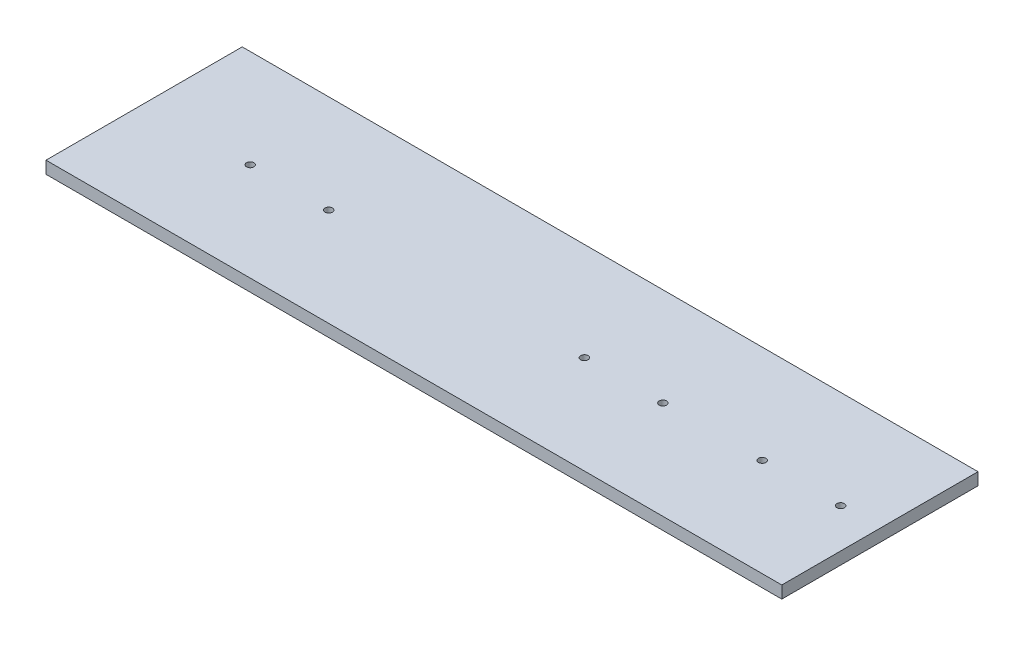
ISO-10303-21;
HEADER;
FILE_DESCRIPTION(('STEP AP214'),'2;1');
FILE_NAME('part.step','',(''),(''),'','','');
FILE_SCHEMA(('AUTOMOTIVE_DESIGN { 1 0 10303 214 1 1 1 1 }'));
ENDSEC;
DATA;
#1=APPLICATION_CONTEXT('core data for automotive mechanical design processes');
#2=APPLICATION_PROTOCOL_DEFINITION('international standard','automotive_design',2000,#1);
#3=PRODUCT_CONTEXT('',#1,'mechanical');
#4=PRODUCT('Part','Part','',(#3));
#5=PRODUCT_RELATED_PRODUCT_CATEGORY('part','',(#4));
#6=PRODUCT_DEFINITION_FORMATION('','',#4);
#7=PRODUCT_DEFINITION_CONTEXT('part definition',#1,'design');
#8=PRODUCT_DEFINITION('design','',#6,#7);
#9=PRODUCT_DEFINITION_SHAPE('','',#8);
#10=(LENGTH_UNIT() NAMED_UNIT(*) SI_UNIT(.MILLI.,.METRE.));
#11=(NAMED_UNIT(*) PLANE_ANGLE_UNIT() SI_UNIT($,.RADIAN.));
#12=(NAMED_UNIT(*) SI_UNIT($,.STERADIAN.) SOLID_ANGLE_UNIT());
#13=UNCERTAINTY_MEASURE_WITH_UNIT(LENGTH_MEASURE(1.E-05),#10,'distance_accuracy_value','');
#14=(GEOMETRIC_REPRESENTATION_CONTEXT(3) GLOBAL_UNCERTAINTY_ASSIGNED_CONTEXT((#13)) GLOBAL_UNIT_ASSIGNED_CONTEXT((#10,
#11,#12)) REPRESENTATION_CONTEXT('',''));
#15=CARTESIAN_POINT('',(0.,0.,0.));
#16=DIRECTION('',(0.,0.,1.));
#17=DIRECTION('',(1.,0.,0.));
#18=AXIS2_PLACEMENT_3D('',#15,#16,#17);
#19=CARTESIAN_POINT('',(300.,10.,80.));
#20=DIRECTION('',(-1.,0.,0.));
#21=DIRECTION('',(0.,0.,1.));
#22=AXIS2_PLACEMENT_3D('',#19,#20,#21);
#23=PLANE('',#22);
#24=DIRECTION('',(0.,0.,-1.));
#25=VECTOR('',#24,1.);
#26=CARTESIAN_POINT('',(300.,0.,80.));
#27=LINE('',#26,#25);
#28=CARTESIAN_POINT('',(300.,0.,80.));
#29=VERTEX_POINT('',#28);
#30=CARTESIAN_POINT('',(300.,0.,-80.));
#31=VERTEX_POINT('',#30);
#32=EDGE_CURVE('E96',#29,#31,#27,.T.);
#33=ORIENTED_EDGE('',*,*,#32,.T.);
#34=DIRECTION('',(0.,-1.,0.));
#35=VECTOR('',#34,1.);
#36=CARTESIAN_POINT('',(300.,10.,-80.));
#37=LINE('',#36,#35);
#38=CARTESIAN_POINT('',(300.,10.,-80.));
#39=VERTEX_POINT('',#38);
#40=EDGE_CURVE('E11',#39,#31,#37,.T.);
#41=ORIENTED_EDGE('',*,*,#40,.F.);
#42=DIRECTION('',(0.,0.,-1.));
#43=VECTOR('',#42,1.);
#44=CARTESIAN_POINT('',(300.,10.,80.));
#45=LINE('',#44,#43);
#46=CARTESIAN_POINT('',(300.,10.,80.));
#47=VERTEX_POINT('',#46);
#48=EDGE_CURVE('E84',#47,#39,#45,.T.);
#49=ORIENTED_EDGE('',*,*,#48,.F.);
#50=DIRECTION('',(0.,-1.,0.));
#51=VECTOR('',#50,1.);
#52=CARTESIAN_POINT('',(300.,10.,80.));
#53=LINE('',#52,#51);
#54=EDGE_CURVE('E92',#47,#29,#53,.T.);
#55=ORIENTED_EDGE('',*,*,#54,.T.);
#56=EDGE_LOOP('',(#33,#41,#49,#55));
#57=FACE_BOUND('',#56,.T.);
#58=ADVANCED_FACE('F33',(#57),#23,.F.);
#59=CARTESIAN_POINT('',(-300.,10.,-80.));
#60=DIRECTION('',(0.,0.,1.));
#61=DIRECTION('',(1.,0.,0.));
#62=AXIS2_PLACEMENT_3D('',#59,#60,#61);
#63=PLANE('',#62);
#64=DIRECTION('',(-1.,0.,0.));
#65=VECTOR('',#64,1.);
#66=CARTESIAN_POINT('',(-300.,0.,-80.));
#67=LINE('',#66,#65);
#68=CARTESIAN_POINT('',(-300.,0.,-80.));
#69=VERTEX_POINT('',#68);
#70=EDGE_CURVE('E88',#31,#69,#67,.T.);
#71=ORIENTED_EDGE('',*,*,#70,.T.);
#72=DIRECTION('',(0.,-1.,0.));
#73=VECTOR('',#72,1.);
#74=CARTESIAN_POINT('',(-300.,10.,-80.));
#75=LINE('',#74,#73);
#76=CARTESIAN_POINT('',(-300.,10.,-80.));
#77=VERTEX_POINT('',#76);
#78=EDGE_CURVE('E41',#77,#69,#75,.T.);
#79=ORIENTED_EDGE('',*,*,#78,.F.);
#80=DIRECTION('',(-1.,0.,0.));
#81=VECTOR('',#80,1.);
#82=CARTESIAN_POINT('',(-300.,10.,-80.));
#83=LINE('',#82,#81);
#84=EDGE_CURVE('E79',#39,#77,#83,.T.);
#85=ORIENTED_EDGE('',*,*,#84,.F.);
#86=ORIENTED_EDGE('',*,*,#40,.T.);
#87=EDGE_LOOP('',(#71,#79,#85,#86));
#88=FACE_BOUND('',#87,.T.);
#89=ADVANCED_FACE('F87',(#88),#63,.F.);
#90=CARTESIAN_POINT('',(-300.,10.,80.));
#91=DIRECTION('',(1.,0.,0.));
#92=DIRECTION('',(0.,0.,-1.));
#93=AXIS2_PLACEMENT_3D('',#90,#91,#92);
#94=PLANE('',#93);
#95=DIRECTION('',(0.,0.,1.));
#96=VECTOR('',#95,1.);
#97=CARTESIAN_POINT('',(-300.,0.,80.));
#98=LINE('',#97,#96);
#99=CARTESIAN_POINT('',(-300.,0.,80.));
#100=VERTEX_POINT('',#99);
#101=EDGE_CURVE('E66',#69,#100,#98,.T.);
#102=ORIENTED_EDGE('',*,*,#101,.T.);
#103=DIRECTION('',(0.,-1.,0.));
#104=VECTOR('',#103,1.);
#105=CARTESIAN_POINT('',(-300.,10.,80.));
#106=LINE('',#105,#104);
#107=CARTESIAN_POINT('',(-300.,10.,80.));
#108=VERTEX_POINT('',#107);
#109=EDGE_CURVE('E89',#108,#100,#106,.T.);
#110=ORIENTED_EDGE('',*,*,#109,.F.);
#111=DIRECTION('',(0.,0.,1.));
#112=VECTOR('',#111,1.);
#113=CARTESIAN_POINT('',(-300.,10.,80.));
#114=LINE('',#113,#112);
#115=EDGE_CURVE('E82',#77,#108,#114,.T.);
#116=ORIENTED_EDGE('',*,*,#115,.F.);
#117=ORIENTED_EDGE('',*,*,#78,.T.);
#118=EDGE_LOOP('',(#102,#110,#116,#117));
#119=FACE_BOUND('',#118,.T.);
#120=ADVANCED_FACE('F90',(#119),#94,.F.);
#121=CARTESIAN_POINT('',(-300.,10.,80.));
#122=DIRECTION('',(0.,0.,-1.));
#123=DIRECTION('',(-1.,0.,0.));
#124=AXIS2_PLACEMENT_3D('',#121,#122,#123);
#125=PLANE('',#124);
#126=DIRECTION('',(1.,0.,0.));
#127=VECTOR('',#126,1.);
#128=CARTESIAN_POINT('',(-300.,0.,80.));
#129=LINE('',#128,#127);
#130=EDGE_CURVE('E72',#100,#29,#129,.T.);
#131=ORIENTED_EDGE('',*,*,#130,.T.);
#132=ORIENTED_EDGE('',*,*,#54,.F.);
#133=DIRECTION('',(1.,0.,0.));
#134=VECTOR('',#133,1.);
#135=CARTESIAN_POINT('',(-300.,10.,80.));
#136=LINE('',#135,#134);
#137=EDGE_CURVE('E49',#108,#47,#136,.T.);
#138=ORIENTED_EDGE('',*,*,#137,.F.);
#139=ORIENTED_EDGE('',*,*,#109,.T.);
#140=EDGE_LOOP('',(#131,#132,#138,#139));
#141=FACE_BOUND('',#140,.T.);
#142=ADVANCED_FACE('F104',(#141),#125,.F.);
#143=CARTESIAN_POINT('',(0.,10.,0.));
#144=DIRECTION('',(0.,-1.,0.));
#145=DIRECTION('',(0.,0.,-1.));
#146=AXIS2_PLACEMENT_3D('',#143,#144,#145);
#147=PLANE('',#146);
#148=CARTESIAN_POINT('',(-149.473266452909,10.,0.));
#149=DIRECTION('',(0.,-1.,0.));
#150=DIRECTION('',(0.,0.,-1.));
#151=AXIS2_PLACEMENT_3D('',#148,#149,#150);
#152=CIRCLE('',#151,2.99999999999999);
#153=CARTESIAN_POINT('',(-149.473266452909,10.,-2.99999999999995));
#154=VERTEX_POINT('',#153);
#155=EDGE_CURVE('E113',#154,#154,#152,.T.);
#156=ORIENTED_EDGE('',*,*,#155,.T.);
#157=EDGE_LOOP('',(#156));
#158=FACE_BOUND('',#157,.T.);
#159=CARTESIAN_POINT('',(59.,10.,0.));
#160=DIRECTION('',(0.,-1.,0.));
#161=DIRECTION('',(0.,0.,-1.));
#162=AXIS2_PLACEMENT_3D('',#159,#160,#161);
#163=CIRCLE('',#162,3.);
#164=CARTESIAN_POINT('',(59.,10.,-2.99999999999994));
#165=VERTEX_POINT('',#164);
#166=EDGE_CURVE('E137',#165,#165,#163,.T.);
#167=ORIENTED_EDGE('',*,*,#166,.T.);
#168=EDGE_LOOP('',(#167));
#169=FACE_BOUND('',#168,.T.);
#170=CARTESIAN_POINT('',(123.,10.,0.));
#171=DIRECTION('',(0.,-1.,0.));
#172=DIRECTION('',(0.,0.,-1.));
#173=AXIS2_PLACEMENT_3D('',#170,#171,#172);
#174=CIRCLE('',#173,2.99999999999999);
#175=CARTESIAN_POINT('',(123.,10.,-2.99999999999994));
#176=VERTEX_POINT('',#175);
#177=EDGE_CURVE('E131',#176,#176,#174,.T.);
#178=ORIENTED_EDGE('',*,*,#177,.T.);
#179=EDGE_LOOP('',(#178));
#180=FACE_BOUND('',#179,.T.);
#181=CARTESIAN_POINT('',(204.,10.,0.));
#182=DIRECTION('',(0.,-1.,0.));
#183=DIRECTION('',(0.,0.,-1.));
#184=AXIS2_PLACEMENT_3D('',#181,#182,#183);
#185=CIRCLE('',#184,2.99999999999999);
#186=CARTESIAN_POINT('',(204.,10.,-2.99999999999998));
#187=VERTEX_POINT('',#186);
#188=EDGE_CURVE('E125',#187,#187,#185,.T.);
#189=ORIENTED_EDGE('',*,*,#188,.T.);
#190=EDGE_LOOP('',(#189));
#191=FACE_BOUND('',#190,.T.);
#192=CARTESIAN_POINT('',(268.,10.,0.));
#193=DIRECTION('',(0.,-1.,0.));
#194=DIRECTION('',(0.,0.,-1.));
#195=AXIS2_PLACEMENT_3D('',#192,#193,#194);
#196=CIRCLE('',#195,2.99999999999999);
#197=CARTESIAN_POINT('',(268.,10.,-2.99999999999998));
#198=VERTEX_POINT('',#197);
#199=EDGE_CURVE('E119',#198,#198,#196,.T.);
#200=ORIENTED_EDGE('',*,*,#199,.T.);
#201=EDGE_LOOP('',(#200));
#202=FACE_BOUND('',#201,.T.);
#203=CARTESIAN_POINT('',(-213.473266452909,10.,0.));
#204=DIRECTION('',(0.,-1.,0.));
#205=DIRECTION('',(0.,0.,-1.));
#206=AXIS2_PLACEMENT_3D('',#203,#204,#205);
#207=CIRCLE('',#206,2.99999999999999);
#208=CARTESIAN_POINT('',(-213.473266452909,10.,-2.99999999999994));
#209=VERTEX_POINT('',#208);
#210=EDGE_CURVE('E99',#209,#209,#207,.T.);
#211=ORIENTED_EDGE('',*,*,#210,.T.);
#212=EDGE_LOOP('',(#211));
#213=FACE_BOUND('',#212,.T.);
#214=ORIENTED_EDGE('',*,*,#48,.T.);
#215=ORIENTED_EDGE('',*,*,#84,.T.);
#216=ORIENTED_EDGE('',*,*,#115,.T.);
#217=ORIENTED_EDGE('',*,*,#137,.T.);
#218=EDGE_LOOP('',(#214,#215,#216,#217));
#219=FACE_BOUND('',#218,.T.);
#220=ADVANCED_FACE('F80',(#158,#169,#180,#191,#202,#213,#219),#147,.F.);
#221=CARTESIAN_POINT('',(0.,0.,0.));
#222=DIRECTION('',(0.,-1.,0.));
#223=DIRECTION('',(0.,0.,-1.));
#224=AXIS2_PLACEMENT_3D('',#221,#222,#223);
#225=PLANE('',#224);
#226=CARTESIAN_POINT('',(-149.473266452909,0.,0.));
#227=DIRECTION('',(0.,-1.,0.));
#228=DIRECTION('',(0.,0.,-1.));
#229=AXIS2_PLACEMENT_3D('',#226,#227,#228);
#230=CIRCLE('',#229,2.99999999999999);
#231=CARTESIAN_POINT('',(-149.473266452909,0.,-2.99999999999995));
#232=VERTEX_POINT('',#231);
#233=EDGE_CURVE('E140',#232,#232,#230,.T.);
#234=ORIENTED_EDGE('',*,*,#233,.F.);
#235=EDGE_LOOP('',(#234));
#236=FACE_BOUND('',#235,.T.);
#237=CARTESIAN_POINT('',(59.,0.,0.));
#238=DIRECTION('',(0.,-1.,0.));
#239=DIRECTION('',(0.,0.,-1.));
#240=AXIS2_PLACEMENT_3D('',#237,#238,#239);
#241=CIRCLE('',#240,3.);
#242=CARTESIAN_POINT('',(59.,0.,-2.99999999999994));
#243=VERTEX_POINT('',#242);
#244=EDGE_CURVE('E134',#243,#243,#241,.T.);
#245=ORIENTED_EDGE('',*,*,#244,.F.);
#246=EDGE_LOOP('',(#245));
#247=FACE_BOUND('',#246,.T.);
#248=CARTESIAN_POINT('',(123.,0.,0.));
#249=DIRECTION('',(0.,-1.,0.));
#250=DIRECTION('',(0.,0.,-1.));
#251=AXIS2_PLACEMENT_3D('',#248,#249,#250);
#252=CIRCLE('',#251,2.99999999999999);
#253=CARTESIAN_POINT('',(123.,0.,-2.99999999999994));
#254=VERTEX_POINT('',#253);
#255=EDGE_CURVE('E128',#254,#254,#252,.T.);
#256=ORIENTED_EDGE('',*,*,#255,.F.);
#257=EDGE_LOOP('',(#256));
#258=FACE_BOUND('',#257,.T.);
#259=CARTESIAN_POINT('',(204.,0.,0.));
#260=DIRECTION('',(0.,-1.,0.));
#261=DIRECTION('',(0.,0.,-1.));
#262=AXIS2_PLACEMENT_3D('',#259,#260,#261);
#263=CIRCLE('',#262,2.99999999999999);
#264=CARTESIAN_POINT('',(204.,0.,-2.99999999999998));
#265=VERTEX_POINT('',#264);
#266=EDGE_CURVE('E122',#265,#265,#263,.T.);
#267=ORIENTED_EDGE('',*,*,#266,.F.);
#268=EDGE_LOOP('',(#267));
#269=FACE_BOUND('',#268,.T.);
#270=CARTESIAN_POINT('',(268.,0.,0.));
#271=DIRECTION('',(0.,-1.,0.));
#272=DIRECTION('',(0.,0.,-1.));
#273=AXIS2_PLACEMENT_3D('',#270,#271,#272);
#274=CIRCLE('',#273,2.99999999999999);
#275=CARTESIAN_POINT('',(268.,0.,-2.99999999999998));
#276=VERTEX_POINT('',#275);
#277=EDGE_CURVE('E116',#276,#276,#274,.T.);
#278=ORIENTED_EDGE('',*,*,#277,.F.);
#279=EDGE_LOOP('',(#278));
#280=FACE_BOUND('',#279,.T.);
#281=CARTESIAN_POINT('',(-213.473266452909,0.,0.));
#282=DIRECTION('',(0.,-1.,0.));
#283=DIRECTION('',(0.,0.,-1.));
#284=AXIS2_PLACEMENT_3D('',#281,#282,#283);
#285=CIRCLE('',#284,2.99999999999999);
#286=CARTESIAN_POINT('',(-213.473266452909,0.,-2.99999999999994));
#287=VERTEX_POINT('',#286);
#288=EDGE_CURVE('E110',#287,#287,#285,.T.);
#289=ORIENTED_EDGE('',*,*,#288,.F.);
#290=EDGE_LOOP('',(#289));
#291=FACE_BOUND('',#290,.T.);
#292=ORIENTED_EDGE('',*,*,#32,.F.);
#293=ORIENTED_EDGE('',*,*,#130,.F.);
#294=ORIENTED_EDGE('',*,*,#101,.F.);
#295=ORIENTED_EDGE('',*,*,#70,.F.);
#296=EDGE_LOOP('',(#292,#293,#294,#295));
#297=FACE_BOUND('',#296,.T.);
#298=ADVANCED_FACE('F107',(#236,#247,#258,#269,#280,#291,#297),#225,.T.);
#299=CARTESIAN_POINT('',(-213.473266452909,10.,0.));
#300=DIRECTION('',(0.,-1.,0.));
#301=DIRECTION('',(0.,0.,-1.));
#302=AXIS2_PLACEMENT_3D('',#299,#300,#301);
#303=CYLINDRICAL_SURFACE('',#302,2.99999999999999);
#304=ORIENTED_EDGE('',*,*,#210,.F.);
#305=EDGE_LOOP('',(#304));
#306=FACE_BOUND('',#305,.T.);
#307=ORIENTED_EDGE('',*,*,#288,.T.);
#308=EDGE_LOOP('',(#307));
#309=FACE_BOUND('',#308,.T.);
#310=ADVANCED_FACE('F157',(#306,#309),#303,.F.);
#311=CARTESIAN_POINT('',(268.,10.,0.));
#312=DIRECTION('',(0.,-1.,0.));
#313=DIRECTION('',(0.,0.,-1.));
#314=AXIS2_PLACEMENT_3D('',#311,#312,#313);
#315=CYLINDRICAL_SURFACE('',#314,2.99999999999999);
#316=ORIENTED_EDGE('',*,*,#199,.F.);
#317=EDGE_LOOP('',(#316));
#318=FACE_BOUND('',#317,.T.);
#319=ORIENTED_EDGE('',*,*,#277,.T.);
#320=EDGE_LOOP('',(#319));
#321=FACE_BOUND('',#320,.T.);
#322=ADVANCED_FACE('F170',(#318,#321),#315,.F.);
#323=CARTESIAN_POINT('',(204.,10.,0.));
#324=DIRECTION('',(0.,-1.,0.));
#325=DIRECTION('',(0.,0.,-1.));
#326=AXIS2_PLACEMENT_3D('',#323,#324,#325);
#327=CYLINDRICAL_SURFACE('',#326,2.99999999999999);
#328=ORIENTED_EDGE('',*,*,#188,.F.);
#329=EDGE_LOOP('',(#328));
#330=FACE_BOUND('',#329,.T.);
#331=ORIENTED_EDGE('',*,*,#266,.T.);
#332=EDGE_LOOP('',(#331));
#333=FACE_BOUND('',#332,.T.);
#334=ADVANCED_FACE('F176',(#330,#333),#327,.F.);
#335=CARTESIAN_POINT('',(123.,10.,0.));
#336=DIRECTION('',(0.,-1.,0.));
#337=DIRECTION('',(0.,0.,-1.));
#338=AXIS2_PLACEMENT_3D('',#335,#336,#337);
#339=CYLINDRICAL_SURFACE('',#338,2.99999999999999);
#340=ORIENTED_EDGE('',*,*,#177,.F.);
#341=EDGE_LOOP('',(#340));
#342=FACE_BOUND('',#341,.T.);
#343=ORIENTED_EDGE('',*,*,#255,.T.);
#344=EDGE_LOOP('',(#343));
#345=FACE_BOUND('',#344,.T.);
#346=ADVANCED_FACE('F219',(#342,#345),#339,.F.);
#347=CARTESIAN_POINT('',(59.,10.,0.));
#348=DIRECTION('',(0.,-1.,0.));
#349=DIRECTION('',(0.,0.,-1.));
#350=AXIS2_PLACEMENT_3D('',#347,#348,#349);
#351=CYLINDRICAL_SURFACE('',#350,3.);
#352=ORIENTED_EDGE('',*,*,#166,.F.);
#353=EDGE_LOOP('',(#352));
#354=FACE_BOUND('',#353,.T.);
#355=ORIENTED_EDGE('',*,*,#244,.T.);
#356=EDGE_LOOP('',(#355));
#357=FACE_BOUND('',#356,.T.);
#358=ADVANCED_FACE('F151',(#354,#357),#351,.F.);
#359=CARTESIAN_POINT('',(-149.473266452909,10.,0.));
#360=DIRECTION('',(0.,-1.,0.));
#361=DIRECTION('',(0.,0.,-1.));
#362=AXIS2_PLACEMENT_3D('',#359,#360,#361);
#363=CYLINDRICAL_SURFACE('',#362,2.99999999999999);
#364=ORIENTED_EDGE('',*,*,#155,.F.);
#365=EDGE_LOOP('',(#364));
#366=FACE_BOUND('',#365,.T.);
#367=ORIENTED_EDGE('',*,*,#233,.T.);
#368=EDGE_LOOP('',(#367));
#369=FACE_BOUND('',#368,.T.);
#370=ADVANCED_FACE('F148',(#366,#369),#363,.F.);
#371=CLOSED_SHELL('',(#58,#89,#120,#142,#220,#298,#310,#322,#334,#346,#358,#370));
#372=MANIFOLD_SOLID_BREP('B2',#371);
#373=ADVANCED_BREP_SHAPE_REPRESENTATION('',(#18,#372),#14);
#374=SHAPE_DEFINITION_REPRESENTATION(#9,#373);
ENDSEC;
END-ISO-10303-21;
